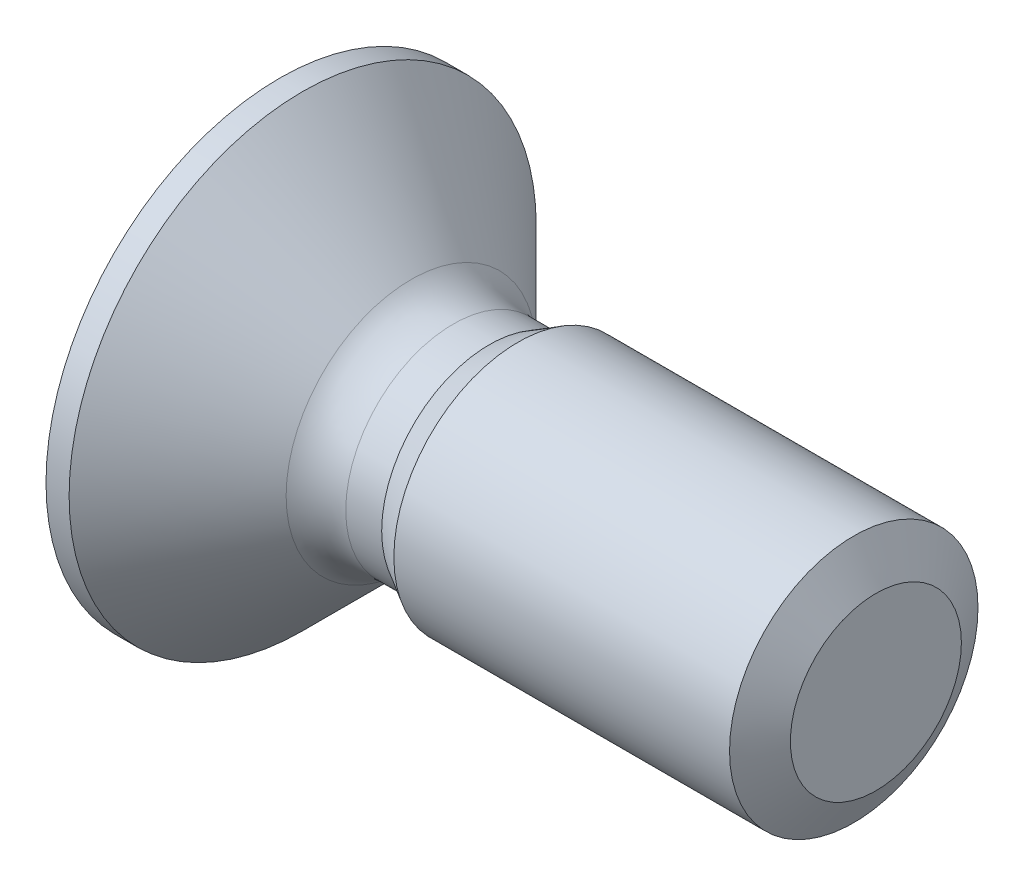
ISO-10303-21;
HEADER;
FILE_DESCRIPTION(('STEP AP214'),'2;1');
FILE_NAME('part.step','',(''),(''),'','','');
FILE_SCHEMA(('AUTOMOTIVE_DESIGN { 1 0 10303 214 1 1 1 1 }'));
ENDSEC;
DATA;
#1=APPLICATION_CONTEXT('core data for automotive mechanical design processes');
#2=APPLICATION_PROTOCOL_DEFINITION('international standard','automotive_design',2000,#1);
#3=PRODUCT_CONTEXT('',#1,'mechanical');
#4=PRODUCT('Part','Part','',(#3));
#5=PRODUCT_RELATED_PRODUCT_CATEGORY('part','',(#4));
#6=PRODUCT_DEFINITION_FORMATION('','',#4);
#7=PRODUCT_DEFINITION_CONTEXT('part definition',#1,'design');
#8=PRODUCT_DEFINITION('design','',#6,#7);
#9=PRODUCT_DEFINITION_SHAPE('','',#8);
#10=(LENGTH_UNIT() NAMED_UNIT(*) SI_UNIT(.MILLI.,.METRE.));
#11=(NAMED_UNIT(*) PLANE_ANGLE_UNIT() SI_UNIT($,.RADIAN.));
#12=(NAMED_UNIT(*) SI_UNIT($,.STERADIAN.) SOLID_ANGLE_UNIT());
#13=UNCERTAINTY_MEASURE_WITH_UNIT(LENGTH_MEASURE(1.E-05),#10,'distance_accuracy_value','');
#14=(GEOMETRIC_REPRESENTATION_CONTEXT(3) GLOBAL_UNCERTAINTY_ASSIGNED_CONTEXT((#13)) GLOBAL_UNIT_ASSIGNED_CONTEXT((#10,
#11,#12)) REPRESENTATION_CONTEXT('',''));
#15=CARTESIAN_POINT('',(0.,0.,0.));
#16=DIRECTION('',(0.,0.,1.));
#17=DIRECTION('',(1.,0.,0.));
#18=AXIS2_PLACEMENT_3D('',#15,#16,#17);
#19=CARTESIAN_POINT('',(0.,1.45,0.225000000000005));
#20=DIRECTION('',(0.627329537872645,0.778753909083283,0.));
#21=DIRECTION('',(0.,0.,-1.));
#22=AXIS2_PLACEMENT_3D('',#19,#20,#21);
#23=PLANE('',#22);
#24=DIRECTION('',(0.775090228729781,-0.624378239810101,-0.0968862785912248));
#25=VECTOR('',#24,1.);
#26=CARTESIAN_POINT('',(0.,1.45,0.225000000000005));
#27=LINE('',#26,#25);
#28=CARTESIAN_POINT('',(0.,1.45,0.225000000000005));
#29=VERTEX_POINT('',#28);
#30=CARTESIAN_POINT('',(1.8,0.,0.));
#31=VERTEX_POINT('',#30);
#32=EDGE_CURVE('E25',#29,#31,#27,.T.);
#33=ORIENTED_EDGE('',*,*,#32,.F.);
#34=DIRECTION('',(0.,0.,-1.));
#35=VECTOR('',#34,1.);
#36=CARTESIAN_POINT('',(0.,1.45,0.225000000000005));
#37=LINE('',#36,#35);
#38=CARTESIAN_POINT('',(0.,1.45,-0.224999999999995));
#39=VERTEX_POINT('',#38);
#40=EDGE_CURVE('E172',#29,#39,#37,.T.);
#41=ORIENTED_EDGE('',*,*,#40,.T.);
#42=DIRECTION('',(0.775090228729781,-0.624378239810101,0.0968862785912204));
#43=VECTOR('',#42,1.);
#44=CARTESIAN_POINT('',(0.,1.45,-0.224999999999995));
#45=LINE('',#44,#43);
#46=EDGE_CURVE('E11',#39,#31,#45,.T.);
#47=ORIENTED_EDGE('',*,*,#46,.T.);
#48=EDGE_LOOP('',(#33,#41,#47));
#49=FACE_BOUND('',#48,.T.);
#50=ADVANCED_FACE('F17',(#49),#23,.F.);
#51=CARTESIAN_POINT('',(1.8,0.,0.));
#52=DIRECTION('',(-0.124034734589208,0.,0.992277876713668));
#53=DIRECTION('',(0.,1.,0.));
#54=AXIS2_PLACEMENT_3D('',#51,#52,#53);
#55=PLANE('',#54);
#56=ORIENTED_EDGE('',*,*,#46,.F.);
#57=DIRECTION('',(0.,-1.,0.));
#58=VECTOR('',#57,1.);
#59=CARTESIAN_POINT('',(0.,1.45,-0.224999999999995));
#60=LINE('',#59,#58);
#61=CARTESIAN_POINT('',(0.,0.225,-0.225));
#62=VERTEX_POINT('',#61);
#63=EDGE_CURVE('E113',#39,#62,#60,.T.);
#64=ORIENTED_EDGE('',*,*,#63,.T.);
#65=DIRECTION('',(-0.984731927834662,0.123091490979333,-0.123091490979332));
#66=VECTOR('',#65,1.);
#67=CARTESIAN_POINT('',(1.8,0.,0.));
#68=LINE('',#67,#66);
#69=EDGE_CURVE('E104',#31,#62,#68,.T.);
#70=ORIENTED_EDGE('',*,*,#69,.F.);
#71=EDGE_LOOP('',(#56,#64,#70));
#72=FACE_BOUND('',#71,.T.);
#73=ADVANCED_FACE('F215',(#72),#55,.T.);
#74=CARTESIAN_POINT('',(1.8,0.,0.));
#75=DIRECTION('',(-0.124034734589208,0.,-0.992277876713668));
#76=DIRECTION('',(-0.992277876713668,0.,0.124034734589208));
#77=AXIS2_PLACEMENT_3D('',#74,#75,#76);
#78=PLANE('',#77);
#79=DIRECTION('',(0.,1.,0.));
#80=VECTOR('',#79,1.);
#81=CARTESIAN_POINT('',(0.,1.45,0.225000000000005));
#82=LINE('',#81,#80);
#83=CARTESIAN_POINT('',(0.,0.225,0.225));
#84=VERTEX_POINT('',#83);
#85=EDGE_CURVE('E134',#84,#29,#82,.T.);
#86=ORIENTED_EDGE('',*,*,#85,.T.);
#87=ORIENTED_EDGE('',*,*,#32,.T.);
#88=DIRECTION('',(0.984731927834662,-0.123091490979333,-0.123091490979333));
#89=VECTOR('',#88,1.);
#90=CARTESIAN_POINT('',(1.8,0.,0.));
#91=LINE('',#90,#89);
#92=EDGE_CURVE('E175',#84,#31,#91,.T.);
#93=ORIENTED_EDGE('',*,*,#92,.F.);
#94=EDGE_LOOP('',(#86,#87,#93));
#95=FACE_BOUND('',#94,.T.);
#96=ADVANCED_FACE('F198',(#95),#78,.T.);
#97=CARTESIAN_POINT('',(0.,-1.45,-0.225000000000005));
#98=DIRECTION('',(0.627329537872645,-0.778753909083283,0.));
#99=DIRECTION('',(0.,0.,-1.));
#100=AXIS2_PLACEMENT_3D('',#97,#98,#99);
#101=PLANE('',#100);
#102=DIRECTION('',(0.775090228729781,0.624378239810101,0.0968862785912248));
#103=VECTOR('',#102,1.);
#104=CARTESIAN_POINT('',(0.,-1.45,-0.225000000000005));
#105=LINE('',#104,#103);
#106=CARTESIAN_POINT('',(0.,-1.45,-0.225000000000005));
#107=VERTEX_POINT('',#106);
#108=EDGE_CURVE('E169',#107,#31,#105,.T.);
#109=ORIENTED_EDGE('',*,*,#108,.F.);
#110=DIRECTION('',(0.,0.,1.));
#111=VECTOR('',#110,1.);
#112=CARTESIAN_POINT('',(0.,-1.45,0.224999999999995));
#113=LINE('',#112,#111);
#114=CARTESIAN_POINT('',(0.,-1.45,0.224999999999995));
#115=VERTEX_POINT('',#114);
#116=EDGE_CURVE('E158',#107,#115,#113,.T.);
#117=ORIENTED_EDGE('',*,*,#116,.T.);
#118=DIRECTION('',(0.775090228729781,0.624378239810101,-0.0968862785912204));
#119=VECTOR('',#118,1.);
#120=CARTESIAN_POINT('',(0.,-1.45,0.224999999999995));
#121=LINE('',#120,#119);
#122=EDGE_CURVE('E165',#115,#31,#121,.T.);
#123=ORIENTED_EDGE('',*,*,#122,.T.);
#124=EDGE_LOOP('',(#109,#117,#123));
#125=FACE_BOUND('',#124,.T.);
#126=ADVANCED_FACE('F205',(#125),#101,.F.);
#127=CARTESIAN_POINT('',(1.8,0.,0.));
#128=DIRECTION('',(-0.124034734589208,0.,0.992277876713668));
#129=DIRECTION('',(0.,1.,0.));
#130=AXIS2_PLACEMENT_3D('',#127,#128,#129);
#131=PLANE('',#130);
#132=DIRECTION('',(0.,-1.,0.));
#133=VECTOR('',#132,1.);
#134=CARTESIAN_POINT('',(0.,1.45,-0.224999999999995));
#135=LINE('',#134,#133);
#136=CARTESIAN_POINT('',(0.,-0.225,-0.225));
#137=VERTEX_POINT('',#136);
#138=EDGE_CURVE('E128',#137,#107,#135,.T.);
#139=ORIENTED_EDGE('',*,*,#138,.T.);
#140=ORIENTED_EDGE('',*,*,#108,.T.);
#141=DIRECTION('',(0.984731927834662,0.123091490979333,0.123091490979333));
#142=VECTOR('',#141,1.);
#143=CARTESIAN_POINT('',(1.8,0.,0.));
#144=LINE('',#143,#142);
#145=EDGE_CURVE('E187',#137,#31,#144,.T.);
#146=ORIENTED_EDGE('',*,*,#145,.F.);
#147=EDGE_LOOP('',(#139,#140,#146));
#148=FACE_BOUND('',#147,.T.);
#149=ADVANCED_FACE('F202',(#148),#131,.T.);
#150=CARTESIAN_POINT('',(1.8,0.,0.));
#151=DIRECTION('',(-0.124034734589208,0.,-0.992277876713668));
#152=DIRECTION('',(-0.992277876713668,0.,0.124034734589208));
#153=AXIS2_PLACEMENT_3D('',#150,#151,#152);
#154=PLANE('',#153);
#155=ORIENTED_EDGE('',*,*,#122,.F.);
#156=DIRECTION('',(0.,1.,0.));
#157=VECTOR('',#156,1.);
#158=CARTESIAN_POINT('',(0.,1.45,0.225000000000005));
#159=LINE('',#158,#157);
#160=CARTESIAN_POINT('',(0.,-0.225,0.225));
#161=VERTEX_POINT('',#160);
#162=EDGE_CURVE('E154',#115,#161,#159,.T.);
#163=ORIENTED_EDGE('',*,*,#162,.T.);
#164=DIRECTION('',(-0.984731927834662,-0.123091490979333,0.123091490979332));
#165=VECTOR('',#164,1.);
#166=CARTESIAN_POINT('',(1.8,0.,0.));
#167=LINE('',#166,#165);
#168=EDGE_CURVE('E184',#31,#161,#167,.T.);
#169=ORIENTED_EDGE('',*,*,#168,.F.);
#170=EDGE_LOOP('',(#155,#163,#169));
#171=FACE_BOUND('',#170,.T.);
#172=ADVANCED_FACE('F209',(#171),#154,.T.);
#173=CARTESIAN_POINT('',(0.,-0.225,1.45));
#174=DIRECTION('',(0.627329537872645,0.,0.778753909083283));
#175=DIRECTION('',(0.,-1.,0.));
#176=AXIS2_PLACEMENT_3D('',#173,#174,#175);
#177=PLANE('',#176);
#178=DIRECTION('',(0.775090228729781,0.0968862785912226,-0.624378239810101));
#179=VECTOR('',#178,1.);
#180=CARTESIAN_POINT('',(0.,-0.225,1.45));
#181=LINE('',#180,#179);
#182=CARTESIAN_POINT('',(0.,-0.225,1.45));
#183=VERTEX_POINT('',#182);
#184=EDGE_CURVE('E180',#183,#31,#181,.T.);
#185=ORIENTED_EDGE('',*,*,#184,.F.);
#186=DIRECTION('',(0.,1.,0.));
#187=VECTOR('',#186,1.);
#188=CARTESIAN_POINT('',(0.,0.225,1.45));
#189=LINE('',#188,#187);
#190=CARTESIAN_POINT('',(0.,0.225,1.45));
#191=VERTEX_POINT('',#190);
#192=EDGE_CURVE('E146',#183,#191,#189,.T.);
#193=ORIENTED_EDGE('',*,*,#192,.T.);
#194=DIRECTION('',(0.775090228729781,-0.0968862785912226,-0.624378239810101));
#195=VECTOR('',#194,1.);
#196=CARTESIAN_POINT('',(0.,0.225,1.45));
#197=LINE('',#196,#195);
#198=EDGE_CURVE('E105',#191,#31,#197,.T.);
#199=ORIENTED_EDGE('',*,*,#198,.T.);
#200=EDGE_LOOP('',(#185,#193,#199));
#201=FACE_BOUND('',#200,.T.);
#202=ADVANCED_FACE('F231',(#201),#177,.F.);
#203=CARTESIAN_POINT('',(0.,0.225,-1.45));
#204=DIRECTION('',(0.627329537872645,0.,-0.778753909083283));
#205=DIRECTION('',(0.,-1.,0.));
#206=AXIS2_PLACEMENT_3D('',#203,#204,#205);
#207=PLANE('',#206);
#208=DIRECTION('',(0.775090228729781,-0.0968862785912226,0.624378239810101));
#209=VECTOR('',#208,1.);
#210=CARTESIAN_POINT('',(0.,0.225,-1.45));
#211=LINE('',#210,#209);
#212=CARTESIAN_POINT('',(0.,0.225,-1.45));
#213=VERTEX_POINT('',#212);
#214=EDGE_CURVE('E93',#213,#31,#211,.T.);
#215=ORIENTED_EDGE('',*,*,#214,.F.);
#216=DIRECTION('',(0.,-1.,0.));
#217=VECTOR('',#216,1.);
#218=CARTESIAN_POINT('',(0.,0.225,-1.45));
#219=LINE('',#218,#217);
#220=CARTESIAN_POINT('',(0.,-0.225,-1.45));
#221=VERTEX_POINT('',#220);
#222=EDGE_CURVE('E97',#213,#221,#219,.T.);
#223=ORIENTED_EDGE('',*,*,#222,.T.);
#224=DIRECTION('',(0.775090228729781,0.0968862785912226,0.624378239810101));
#225=VECTOR('',#224,1.);
#226=CARTESIAN_POINT('',(0.,-0.225,-1.45));
#227=LINE('',#226,#225);
#228=EDGE_CURVE('E99',#221,#31,#227,.T.);
#229=ORIENTED_EDGE('',*,*,#228,.T.);
#230=EDGE_LOOP('',(#215,#223,#229));
#231=FACE_BOUND('',#230,.T.);
#232=ADVANCED_FACE('F95',(#231),#207,.F.);
#233=CARTESIAN_POINT('',(6.,1.25,0.));
#234=DIRECTION('',(-1.,0.,0.));
#235=DIRECTION('',(0.,0.,1.));
#236=AXIS2_PLACEMENT_3D('',#233,#234,#235);
#237=PLANE('',#236);
#238=CARTESIAN_POINT('',(6.,0.,0.));
#239=DIRECTION('',(1.,0.,0.));
#240=DIRECTION('',(0.,0.,-1.));
#241=AXIS2_PLACEMENT_3D('',#238,#239,#240);
#242=CIRCLE('',#241,0.8603);
#243=CARTESIAN_POINT('',(6.,0.,-0.8603));
#244=VERTEX_POINT('',#243);
#245=EDGE_CURVE('E291',#244,#244,#242,.T.);
#246=ORIENTED_EDGE('',*,*,#245,.T.);
#247=EDGE_LOOP('',(#246));
#248=FACE_BOUND('',#247,.T.);
#249=ADVANCED_FACE('F236',(#248),#237,.F.);
#250=CARTESIAN_POINT('',(1.8,0.,0.));
#251=DIRECTION('',(-0.124034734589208,0.992277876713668,0.));
#252=DIRECTION('',(0.,0.,1.));
#253=AXIS2_PLACEMENT_3D('',#250,#251,#252);
#254=PLANE('',#253);
#255=DIRECTION('',(0.,0.,1.));
#256=VECTOR('',#255,1.);
#257=CARTESIAN_POINT('',(0.,-0.225,-1.45));
#258=LINE('',#257,#256);
#259=EDGE_CURVE('E120',#221,#137,#258,.T.);
#260=ORIENTED_EDGE('',*,*,#259,.T.);
#261=ORIENTED_EDGE('',*,*,#145,.T.);
#262=ORIENTED_EDGE('',*,*,#228,.F.);
#263=EDGE_LOOP('',(#260,#261,#262));
#264=FACE_BOUND('',#263,.T.);
#265=ADVANCED_FACE('F238',(#264),#254,.T.);
#266=CARTESIAN_POINT('',(1.8,0.,0.));
#267=DIRECTION('',(-0.124034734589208,0.992277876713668,0.));
#268=DIRECTION('',(0.,0.,1.));
#269=AXIS2_PLACEMENT_3D('',#266,#267,#268);
#270=PLANE('',#269);
#271=ORIENTED_EDGE('',*,*,#184,.T.);
#272=ORIENTED_EDGE('',*,*,#168,.T.);
#273=DIRECTION('',(0.,0.,1.));
#274=VECTOR('',#273,1.);
#275=CARTESIAN_POINT('',(0.,-0.225,-1.45));
#276=LINE('',#275,#274);
#277=EDGE_CURVE('E150',#161,#183,#276,.T.);
#278=ORIENTED_EDGE('',*,*,#277,.T.);
#279=EDGE_LOOP('',(#271,#272,#278));
#280=FACE_BOUND('',#279,.T.);
#281=ADVANCED_FACE('F212',(#280),#270,.T.);
#282=CARTESIAN_POINT('',(1.8,0.,0.));
#283=DIRECTION('',(-0.124034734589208,-0.992277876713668,0.));
#284=DIRECTION('',(-0.992277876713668,0.124034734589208,0.));
#285=AXIS2_PLACEMENT_3D('',#282,#283,#284);
#286=PLANE('',#285);
#287=ORIENTED_EDGE('',*,*,#214,.T.);
#288=ORIENTED_EDGE('',*,*,#69,.T.);
#289=DIRECTION('',(0.,0.,-1.));
#290=VECTOR('',#289,1.);
#291=CARTESIAN_POINT('',(0.,0.225,-1.45));
#292=LINE('',#291,#290);
#293=EDGE_CURVE('E108',#62,#213,#292,.T.);
#294=ORIENTED_EDGE('',*,*,#293,.T.);
#295=EDGE_LOOP('',(#287,#288,#294));
#296=FACE_BOUND('',#295,.T.);
#297=ADVANCED_FACE('F109',(#296),#286,.T.);
#298=CARTESIAN_POINT('',(1.8,0.,0.));
#299=DIRECTION('',(-0.124034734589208,-0.992277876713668,0.));
#300=DIRECTION('',(-0.992277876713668,0.124034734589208,0.));
#301=AXIS2_PLACEMENT_3D('',#298,#299,#300);
#302=PLANE('',#301);
#303=DIRECTION('',(0.,0.,-1.));
#304=VECTOR('',#303,1.);
#305=CARTESIAN_POINT('',(0.,0.225,-1.45));
#306=LINE('',#305,#304);
#307=EDGE_CURVE('E137',#191,#84,#306,.T.);
#308=ORIENTED_EDGE('',*,*,#307,.T.);
#309=ORIENTED_EDGE('',*,*,#92,.T.);
#310=ORIENTED_EDGE('',*,*,#198,.F.);
#311=EDGE_LOOP('',(#308,#309,#310));
#312=FACE_BOUND('',#311,.T.);
#313=ADVANCED_FACE('F245',(#312),#302,.T.);
#314=CARTESIAN_POINT('',(0.,0.,0.));
#315=DIRECTION('',(1.,0.,0.));
#316=DIRECTION('',(0.,1.,0.));
#317=AXIS2_PLACEMENT_3D('',#314,#315,#316);
#318=PLANE('',#317);
#319=ORIENTED_EDGE('',*,*,#85,.F.);
#320=ORIENTED_EDGE('',*,*,#307,.F.);
#321=ORIENTED_EDGE('',*,*,#192,.F.);
#322=ORIENTED_EDGE('',*,*,#277,.F.);
#323=ORIENTED_EDGE('',*,*,#162,.F.);
#324=ORIENTED_EDGE('',*,*,#116,.F.);
#325=ORIENTED_EDGE('',*,*,#138,.F.);
#326=ORIENTED_EDGE('',*,*,#259,.F.);
#327=ORIENTED_EDGE('',*,*,#222,.F.);
#328=ORIENTED_EDGE('',*,*,#293,.F.);
#329=ORIENTED_EDGE('',*,*,#63,.F.);
#330=ORIENTED_EDGE('',*,*,#40,.F.);
#331=EDGE_LOOP('',(#319,#320,#321,#322,#323,#324,#325,#326,#327,#328,#329,#330));
#332=FACE_BOUND('',#331,.T.);
#333=CARTESIAN_POINT('',(0.,0.,0.));
#334=DIRECTION('',(-1.,0.,0.));
#335=DIRECTION('',(0.,0.,1.));
#336=AXIS2_PLACEMENT_3D('',#333,#334,#335);
#337=CIRCLE('',#336,2.35);
#338=CARTESIAN_POINT('',(0.,0.,2.35));
#339=VERTEX_POINT('',#338);
#340=EDGE_CURVE('E138',#339,#339,#337,.T.);
#341=ORIENTED_EDGE('',*,*,#340,.T.);
#342=EDGE_LOOP('',(#341));
#343=FACE_BOUND('',#342,.T.);
#344=ADVANCED_FACE('F116',(#332,#343),#318,.F.);
#345=CARTESIAN_POINT('',(0.,0.,0.));
#346=DIRECTION('',(-1.,0.,0.));
#347=DIRECTION('',(0.,0.,1.));
#348=AXIS2_PLACEMENT_3D('',#345,#346,#347);
#349=CYLINDRICAL_SURFACE('',#348,2.35);
#350=ORIENTED_EDGE('',*,*,#340,.F.);
#351=EDGE_LOOP('',(#350));
#352=FACE_BOUND('',#351,.T.);
#353=CARTESIAN_POINT('',(0.232500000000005,0.,0.));
#354=DIRECTION('',(-1.,0.,0.));
#355=DIRECTION('',(0.,0.,1.));
#356=AXIS2_PLACEMENT_3D('',#353,#354,#355);
#357=CIRCLE('',#356,2.35);
#358=CARTESIAN_POINT('',(0.232500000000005,0.,2.35));
#359=VERTEX_POINT('',#358);
#360=EDGE_CURVE('E142',#359,#359,#357,.T.);
#361=ORIENTED_EDGE('',*,*,#360,.T.);
#362=EDGE_LOOP('',(#361));
#363=FACE_BOUND('',#362,.T.);
#364=ADVANCED_FACE('F253',(#352,#363),#349,.T.);
#365=CARTESIAN_POINT('',(1.32426406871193,0.,0.));
#366=DIRECTION('',(-1.,0.,0.));
#367=DIRECTION('',(0.,0.,1.));
#368=AXIS2_PLACEMENT_3D('',#365,#366,#367);
#369=CONICAL_SURFACE('',#368,1.25823593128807,0.78539816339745);
#370=ORIENTED_EDGE('',*,*,#360,.F.);
#371=EDGE_LOOP('',(#370));
#372=FACE_BOUND('',#371,.T.);
#373=CARTESIAN_POINT('',(1.32426406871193,0.,0.));
#374=DIRECTION('',(-1.,0.,0.));
#375=DIRECTION('',(0.,0.,1.));
#376=AXIS2_PLACEMENT_3D('',#373,#374,#375);
#377=CIRCLE('',#376,1.25823593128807);
#378=CARTESIAN_POINT('',(1.32426406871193,0.,1.25823593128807));
#379=VERTEX_POINT('',#378);
#380=EDGE_CURVE('E132',#379,#379,#377,.T.);
#381=ORIENTED_EDGE('',*,*,#380,.T.);
#382=EDGE_LOOP('',(#381));
#383=FACE_BOUND('',#382,.T.);
#384=ADVANCED_FACE('F256',(#372,#383),#369,.T.);
#385=CARTESIAN_POINT('',(1.74852813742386,0.,0.));
#386=DIRECTION('',(-1.,0.,0.));
#387=DIRECTION('',(0.,0.,1.));
#388=AXIS2_PLACEMENT_3D('',#385,#386,#387);
#389=TOROIDAL_SURFACE('',#388,1.6825,0.6);
#390=CARTESIAN_POINT('',(1.74852813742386,0.,0.));
#391=DIRECTION('',(-1.,0.,0.));
#392=DIRECTION('',(0.,0.,1.));
#393=AXIS2_PLACEMENT_3D('',#390,#391,#392);
#394=CIRCLE('',#393,1.0825);
#395=CARTESIAN_POINT('',(1.74852813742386,0.,1.0825));
#396=VERTEX_POINT('',#395);
#397=EDGE_CURVE('E307',#396,#396,#394,.T.);
#398=ORIENTED_EDGE('',*,*,#397,.T.);
#399=EDGE_LOOP('',(#398));
#400=FACE_BOUND('',#399,.T.);
#401=ORIENTED_EDGE('',*,*,#380,.F.);
#402=EDGE_LOOP('',(#401));
#403=FACE_BOUND('',#402,.T.);
#404=ADVANCED_FACE('F260',(#400,#403),#389,.F.);
#405=CARTESIAN_POINT('',(0.,0.,0.));
#406=DIRECTION('',(-1.,0.,0.));
#407=DIRECTION('',(0.,0.,1.));
#408=AXIS2_PLACEMENT_3D('',#405,#406,#407);
#409=CYLINDRICAL_SURFACE('',#408,1.0825);
#410=ORIENTED_EDGE('',*,*,#397,.F.);
#411=EDGE_LOOP('',(#410));
#412=FACE_BOUND('',#411,.T.);
#413=CARTESIAN_POINT('',(2.10988148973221,0.,0.));
#414=DIRECTION('',(-1.,0.,0.));
#415=DIRECTION('',(0.,0.,1.));
#416=AXIS2_PLACEMENT_3D('',#413,#414,#415);
#417=CIRCLE('',#416,1.0825);
#418=CARTESIAN_POINT('',(2.10988148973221,0.,1.0825));
#419=VERTEX_POINT('',#418);
#420=EDGE_CURVE('E304',#419,#419,#417,.T.);
#421=ORIENTED_EDGE('',*,*,#420,.T.);
#422=EDGE_LOOP('',(#421));
#423=FACE_BOUND('',#422,.T.);
#424=ADVANCED_FACE('F267',(#412,#423),#409,.T.);
#425=CARTESIAN_POINT('',(2.4,0.,0.));
#426=DIRECTION('',(1.,0.,0.));
#427=DIRECTION('',(0.,0.,-1.));
#428=AXIS2_PLACEMENT_3D('',#425,#426,#427);
#429=CONICAL_SURFACE('',#428,1.25,0.523598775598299);
#430=CARTESIAN_POINT('',(2.4,0.,0.));
#431=DIRECTION('',(-1.,0.,0.));
#432=DIRECTION('',(0.,0.,1.));
#433=AXIS2_PLACEMENT_3D('',#430,#431,#432);
#434=CIRCLE('',#433,1.25);
#435=CARTESIAN_POINT('',(2.4,0.,1.25));
#436=VERTEX_POINT('',#435);
#437=EDGE_CURVE('E297',#436,#436,#434,.T.);
#438=ORIENTED_EDGE('',*,*,#437,.T.);
#439=EDGE_LOOP('',(#438));
#440=FACE_BOUND('',#439,.T.);
#441=ORIENTED_EDGE('',*,*,#420,.F.);
#442=EDGE_LOOP('',(#441));
#443=FACE_BOUND('',#442,.T.);
#444=ADVANCED_FACE('F271',(#440,#443),#429,.T.);
#445=CARTESIAN_POINT('',(0.,0.,0.));
#446=DIRECTION('',(-1.,0.,0.));
#447=DIRECTION('',(0.,0.,1.));
#448=AXIS2_PLACEMENT_3D('',#445,#446,#447);
#449=CYLINDRICAL_SURFACE('',#448,1.25);
#450=ORIENTED_EDGE('',*,*,#437,.F.);
#451=EDGE_LOOP('',(#450));
#452=FACE_BOUND('',#451,.T.);
#453=CARTESIAN_POINT('',(5.77743720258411,0.,0.));
#454=DIRECTION('',(1.,0.,0.));
#455=DIRECTION('',(0.,0.,-1.));
#456=AXIS2_PLACEMENT_3D('',#453,#454,#455);
#457=CIRCLE('',#456,1.25);
#458=CARTESIAN_POINT('',(5.77743720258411,0.,-1.25));
#459=VERTEX_POINT('',#458);
#460=EDGE_CURVE('E288',#459,#459,#457,.T.);
#461=ORIENTED_EDGE('',*,*,#460,.F.);
#462=EDGE_LOOP('',(#461));
#463=FACE_BOUND('',#462,.T.);
#464=ADVANCED_FACE('F275',(#452,#463),#449,.T.);
#465=CARTESIAN_POINT('',(5.77743720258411,0.,0.));
#466=DIRECTION('',(-1.,0.,0.));
#467=DIRECTION('',(0.,0.,1.));
#468=AXIS2_PLACEMENT_3D('',#465,#466,#467);
#469=CONICAL_SURFACE('',#468,1.25,1.05188801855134);
#470=ORIENTED_EDGE('',*,*,#460,.T.);
#471=EDGE_LOOP('',(#470));
#472=FACE_BOUND('',#471,.T.);
#473=ORIENTED_EDGE('',*,*,#245,.F.);
#474=EDGE_LOOP('',(#473));
#475=FACE_BOUND('',#474,.T.);
#476=ADVANCED_FACE('F279',(#472,#475),#469,.T.);
#477=CLOSED_SHELL('',(#50,#73,#96,#126,#149,#172,#202,#232,#249,#265,#281,#297,#313,#344,#364,
#384,#404,#424,#444,#464,#476));
#478=MANIFOLD_SOLID_BREP('B1',#477);
#479=ADVANCED_BREP_SHAPE_REPRESENTATION('',(#18,#478),#14);
#480=SHAPE_DEFINITION_REPRESENTATION(#9,#479);
ENDSEC;
END-ISO-10303-21;
